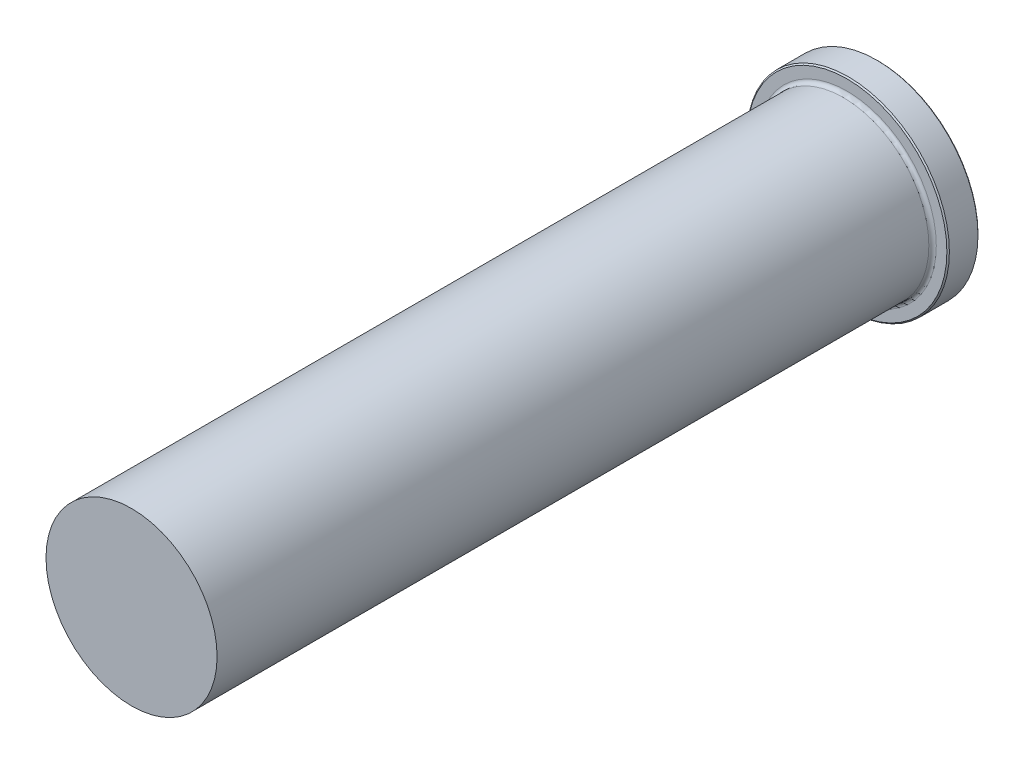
ISO-10303-21;
HEADER;
FILE_DESCRIPTION(('STEP AP214'),'2;1');
FILE_NAME('part.step','',(''),(''),'','','');
FILE_SCHEMA(('AUTOMOTIVE_DESIGN { 1 0 10303 214 1 1 1 1 }'));
ENDSEC;
DATA;
#1=APPLICATION_CONTEXT('core data for automotive mechanical design processes');
#2=APPLICATION_PROTOCOL_DEFINITION('international standard','automotive_design',2000,#1);
#3=PRODUCT_CONTEXT('',#1,'mechanical');
#4=PRODUCT('Part','Part','',(#3));
#5=PRODUCT_RELATED_PRODUCT_CATEGORY('part','',(#4));
#6=PRODUCT_DEFINITION_FORMATION('','',#4);
#7=PRODUCT_DEFINITION_CONTEXT('part definition',#1,'design');
#8=PRODUCT_DEFINITION('design','',#6,#7);
#9=PRODUCT_DEFINITION_SHAPE('','',#8);
#10=(LENGTH_UNIT() NAMED_UNIT(*) SI_UNIT(.MILLI.,.METRE.));
#11=(NAMED_UNIT(*) PLANE_ANGLE_UNIT() SI_UNIT($,.RADIAN.));
#12=(NAMED_UNIT(*) SI_UNIT($,.STERADIAN.) SOLID_ANGLE_UNIT());
#13=UNCERTAINTY_MEASURE_WITH_UNIT(LENGTH_MEASURE(1.E-05),#10,'distance_accuracy_value','');
#14=(GEOMETRIC_REPRESENTATION_CONTEXT(3) GLOBAL_UNCERTAINTY_ASSIGNED_CONTEXT((#13)) GLOBAL_UNIT_ASSIGNED_CONTEXT((#10,
#11,#12)) REPRESENTATION_CONTEXT('',''));
#15=CARTESIAN_POINT('',(0.,0.,0.));
#16=DIRECTION('',(0.,0.,1.));
#17=DIRECTION('',(1.,0.,0.));
#18=AXIS2_PLACEMENT_3D('',#15,#16,#17);
#19=CARTESIAN_POINT('',(0.,0.,0.));
#20=DIRECTION('',(0.,0.,-1.));
#21=DIRECTION('',(-1.,0.,0.));
#22=AXIS2_PLACEMENT_3D('',#19,#20,#21);
#23=PLANE('',#22);
#24=CARTESIAN_POINT('',(0.,0.,0.));
#25=DIRECTION('',(0.,0.,-1.));
#26=DIRECTION('',(-1.,0.,0.));
#27=AXIS2_PLACEMENT_3D('',#24,#25,#26);
#28=CIRCLE('',#27,20.3835);
#29=CARTESIAN_POINT('',(-20.3835,0.,0.));
#30=VERTEX_POINT('',#29);
#31=EDGE_CURVE('E50',#30,#30,#28,.T.);
#32=ORIENTED_EDGE('',*,*,#31,.T.);
#33=EDGE_LOOP('',(#32));
#34=FACE_BOUND('',#33,.T.);
#35=ADVANCED_FACE('F35',(#34),#23,.T.);
#36=CARTESIAN_POINT('',(0.,0.,0.));
#37=DIRECTION('',(0.,0.,-1.));
#38=DIRECTION('',(-1.,0.,0.));
#39=AXIS2_PLACEMENT_3D('',#36,#37,#38);
#40=CYLINDRICAL_SURFACE('',#39,20.6375);
#41=CARTESIAN_POINT('',(0.,0.,0.253999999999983));
#42=DIRECTION('',(0.,0.,-1.));
#43=DIRECTION('',(-1.,0.,0.));
#44=AXIS2_PLACEMENT_3D('',#41,#42,#43);
#45=CIRCLE('',#44,20.6375);
#46=CARTESIAN_POINT('',(-20.6375,0.,0.253999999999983));
#47=VERTEX_POINT('',#46);
#48=EDGE_CURVE('E42',#47,#47,#45,.F.);
#49=ORIENTED_EDGE('',*,*,#48,.T.);
#50=EDGE_LOOP('',(#49));
#51=FACE_BOUND('',#50,.T.);
#52=CARTESIAN_POINT('',(0.,0.,6.09599999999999));
#53=DIRECTION('',(0.,0.,1.));
#54=DIRECTION('',(1.,0.,0.));
#55=AXIS2_PLACEMENT_3D('',#52,#53,#54);
#56=CIRCLE('',#55,20.6375);
#57=CARTESIAN_POINT('',(20.6375,0.,6.09599999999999));
#58=VERTEX_POINT('',#57);
#59=EDGE_CURVE('E46',#58,#58,#56,.F.);
#60=ORIENTED_EDGE('',*,*,#59,.T.);
#61=EDGE_LOOP('',(#60));
#62=FACE_BOUND('',#61,.T.);
#63=ADVANCED_FACE('F82',(#51,#62),#40,.T.);
#64=CARTESIAN_POINT('',(0.,20.6375,6.35));
#65=DIRECTION('',(0.,0.,1.));
#66=DIRECTION('',(1.,0.,0.));
#67=AXIS2_PLACEMENT_3D('',#64,#65,#66);
#68=PLANE('',#67);
#69=CARTESIAN_POINT('',(0.,0.,6.35));
#70=DIRECTION('',(0.,0.,1.));
#71=DIRECTION('',(1.,0.,0.));
#72=AXIS2_PLACEMENT_3D('',#69,#70,#71);
#73=CIRCLE('',#72,20.3835);
#74=CARTESIAN_POINT('',(20.3835,0.,6.35));
#75=VERTEX_POINT('',#74);
#76=EDGE_CURVE('E10',#75,#75,#73,.T.);
#77=ORIENTED_EDGE('',*,*,#76,.T.);
#78=EDGE_LOOP('',(#77));
#79=FACE_BOUND('',#78,.T.);
#80=CARTESIAN_POINT('',(0.,0.,6.35));
#81=DIRECTION('',(0.,0.,1.));
#82=DIRECTION('',(1.,0.,0.));
#83=AXIS2_PLACEMENT_3D('',#80,#81,#82);
#84=CIRCLE('',#83,18.2245);
#85=CARTESIAN_POINT('',(18.2245,0.,6.35));
#86=VERTEX_POINT('',#85);
#87=EDGE_CURVE('E58',#86,#86,#84,.F.);
#88=ORIENTED_EDGE('',*,*,#87,.T.);
#89=EDGE_LOOP('',(#88));
#90=FACE_BOUND('',#89,.T.);
#91=ADVANCED_FACE('F78',(#79,#90),#68,.T.);
#92=CARTESIAN_POINT('',(0.,0.,0.));
#93=DIRECTION('',(0.,0.,-1.));
#94=DIRECTION('',(-1.,0.,0.));
#95=AXIS2_PLACEMENT_3D('',#92,#93,#94);
#96=CYLINDRICAL_SURFACE('',#95,17.4625);
#97=CARTESIAN_POINT('',(0.,0.,7.112));
#98=DIRECTION('',(0.,0.,1.));
#99=DIRECTION('',(1.,0.,0.));
#100=AXIS2_PLACEMENT_3D('',#97,#98,#99);
#101=CIRCLE('',#100,17.4625);
#102=CARTESIAN_POINT('',(17.4625,0.,7.112));
#103=VERTEX_POINT('',#102);
#104=EDGE_CURVE('E55',#103,#103,#101,.T.);
#105=ORIENTED_EDGE('',*,*,#104,.T.);
#106=EDGE_LOOP('',(#105));
#107=FACE_BOUND('',#106,.T.);
#108=CARTESIAN_POINT('',(0.,0.,152.4));
#109=DIRECTION('',(0.,0.,-1.));
#110=DIRECTION('',(-1.,0.,0.));
#111=AXIS2_PLACEMENT_3D('',#108,#109,#110);
#112=CIRCLE('',#111,17.4625);
#113=CARTESIAN_POINT('',(-17.4625,0.,152.4));
#114=VERTEX_POINT('',#113);
#115=EDGE_CURVE('E61',#114,#114,#112,.T.);
#116=ORIENTED_EDGE('',*,*,#115,.T.);
#117=EDGE_LOOP('',(#116));
#118=FACE_BOUND('',#117,.T.);
#119=ADVANCED_FACE('F65',(#107,#118),#96,.T.);
#120=CARTESIAN_POINT('',(0.,17.4625,152.4));
#121=DIRECTION('',(0.,0.,1.));
#122=DIRECTION('',(1.,0.,0.));
#123=AXIS2_PLACEMENT_3D('',#120,#121,#122);
#124=PLANE('',#123);
#125=ORIENTED_EDGE('',*,*,#115,.F.);
#126=EDGE_LOOP('',(#125));
#127=FACE_BOUND('',#126,.T.);
#128=ADVANCED_FACE('F67',(#127),#124,.T.);
#129=CARTESIAN_POINT('',(0.,0.,7.112));
#130=DIRECTION('',(0.,0.,1.));
#131=DIRECTION('',(1.,0.,0.));
#132=AXIS2_PLACEMENT_3D('',#129,#130,#131);
#133=TOROIDAL_SURFACE('',#132,18.2245,0.762);
#134=ORIENTED_EDGE('',*,*,#104,.F.);
#135=EDGE_LOOP('',(#134));
#136=FACE_BOUND('',#135,.T.);
#137=ORIENTED_EDGE('',*,*,#87,.F.);
#138=EDGE_LOOP('',(#137));
#139=FACE_BOUND('',#138,.T.);
#140=ADVANCED_FACE('F69',(#136,#139),#133,.F.);
#141=CARTESIAN_POINT('',(0.,0.,0.));
#142=DIRECTION('',(0.,0.,1.));
#143=DIRECTION('',(1.,0.,0.));
#144=AXIS2_PLACEMENT_3D('',#141,#142,#143);
#145=CONICAL_SURFACE('',#144,20.3835,0.785398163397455);
#146=ORIENTED_EDGE('',*,*,#48,.F.);
#147=EDGE_LOOP('',(#146));
#148=FACE_BOUND('',#147,.T.);
#149=ORIENTED_EDGE('',*,*,#31,.F.);
#150=EDGE_LOOP('',(#149));
#151=FACE_BOUND('',#150,.T.);
#152=ADVANCED_FACE('F75',(#148,#151),#145,.T.);
#153=CARTESIAN_POINT('',(0.,0.,6.09599999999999));
#154=DIRECTION('',(0.,0.,-1.));
#155=DIRECTION('',(-1.,0.,0.));
#156=AXIS2_PLACEMENT_3D('',#153,#154,#155);
#157=CONICAL_SURFACE('',#156,20.6375,0.785398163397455);
#158=ORIENTED_EDGE('',*,*,#76,.F.);
#159=EDGE_LOOP('',(#158));
#160=FACE_BOUND('',#159,.T.);
#161=ORIENTED_EDGE('',*,*,#59,.F.);
#162=EDGE_LOOP('',(#161));
#163=FACE_BOUND('',#162,.T.);
#164=ADVANCED_FACE('F37',(#160,#163),#157,.T.);
#165=CLOSED_SHELL('',(#35,#63,#91,#119,#128,#140,#152,#164));
#166=MANIFOLD_SOLID_BREP('B2',#165);
#167=ADVANCED_BREP_SHAPE_REPRESENTATION('',(#18,#166),#14);
#168=SHAPE_DEFINITION_REPRESENTATION(#9,#167);
ENDSEC;
END-ISO-10303-21;
